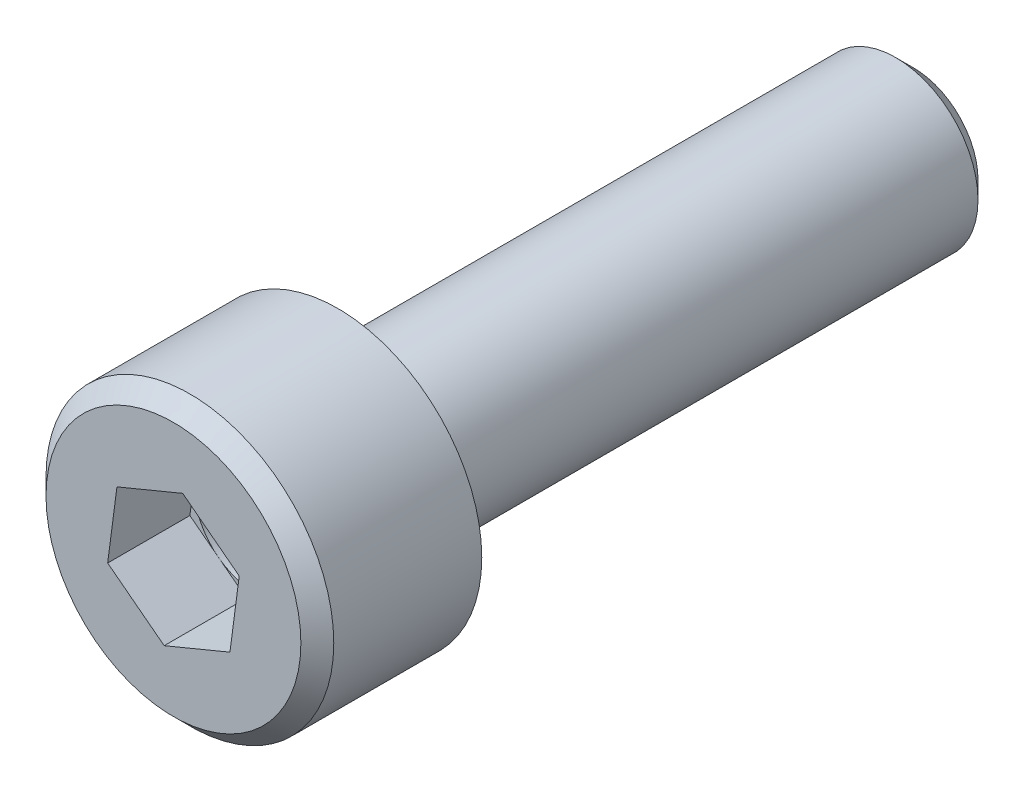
ISO-10303-21;
HEADER;
FILE_DESCRIPTION(('STEP AP214'),'2;1');
FILE_NAME('part.step','',(''),(''),'','','');
FILE_SCHEMA(('AUTOMOTIVE_DESIGN { 1 0 10303 214 1 1 1 1 }'));
ENDSEC;
DATA;
#1=APPLICATION_CONTEXT('core data for automotive mechanical design processes');
#2=APPLICATION_PROTOCOL_DEFINITION('international standard','automotive_design',2000,#1);
#3=PRODUCT_CONTEXT('',#1,'mechanical');
#4=PRODUCT('Part','Part','',(#3));
#5=PRODUCT_RELATED_PRODUCT_CATEGORY('part','',(#4));
#6=PRODUCT_DEFINITION_FORMATION('','',#4);
#7=PRODUCT_DEFINITION_CONTEXT('part definition',#1,'design');
#8=PRODUCT_DEFINITION('design','',#6,#7);
#9=PRODUCT_DEFINITION_SHAPE('','',#8);
#10=(LENGTH_UNIT() NAMED_UNIT(*) SI_UNIT(.MILLI.,.METRE.));
#11=(NAMED_UNIT(*) PLANE_ANGLE_UNIT() SI_UNIT($,.RADIAN.));
#12=(NAMED_UNIT(*) SI_UNIT($,.STERADIAN.) SOLID_ANGLE_UNIT());
#13=UNCERTAINTY_MEASURE_WITH_UNIT(LENGTH_MEASURE(1.E-05),#10,'distance_accuracy_value','');
#14=(GEOMETRIC_REPRESENTATION_CONTEXT(3) GLOBAL_UNCERTAINTY_ASSIGNED_CONTEXT((#13)) GLOBAL_UNIT_ASSIGNED_CONTEXT((#10,
#11,#12)) REPRESENTATION_CONTEXT('',''));
#15=CARTESIAN_POINT('',(0.,0.,0.));
#16=DIRECTION('',(0.,0.,1.));
#17=DIRECTION('',(1.,0.,0.));
#18=AXIS2_PLACEMENT_3D('',#15,#16,#17);
#19=CARTESIAN_POINT('',(-45.7,-8.09999999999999,7.40000000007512));
#20=DIRECTION('',(0.,0.,1.));
#21=DIRECTION('',(1.,0.,0.));
#22=AXIS2_PLACEMENT_3D('',#19,#20,#21);
#23=CONICAL_SURFACE('',#22,1.49999999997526,1.04719754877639);
#24=CARTESIAN_POINT('',(-45.6999999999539,-8.09999999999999,6.53397459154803));
#25=VERTEX_POINT('',#24);
#26=VERTEX_LOOP('',#25);
#27=FACE_BOUND('',#26,.T.);
#28=CARTESIAN_POINT('',(-45.7,-8.09999999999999,7.40000000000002));
#29=DIRECTION('',(0.,0.,-1.));
#30=DIRECTION('',(-1.,0.,0.));
#31=AXIS2_PLACEMENT_3D('',#28,#29,#30);
#32=CIRCLE('',#31,1.5);
#33=CARTESIAN_POINT('',(-47.2,-8.09999999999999,7.40000000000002));
#34=VERTEX_POINT('',#33);
#35=EDGE_CURVE('E114',#34,#34,#32,.F.);
#36=ORIENTED_EDGE('',*,*,#35,.T.);
#37=EDGE_LOOP('',(#36));
#38=FACE_BOUND('',#37,.T.);
#39=ADVANCED_FACE('F17',(#27,#38),#23,.F.);
#40=CARTESIAN_POINT('',(-45.7,-8.09999999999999,10.));
#41=DIRECTION('',(0.,0.,-1.));
#42=DIRECTION('',(-1.,0.,0.));
#43=AXIS2_PLACEMENT_3D('',#40,#41,#42);
#44=CYLINDRICAL_SURFACE('',#43,1.5);
#45=CARTESIAN_POINT('',(-45.7,-8.09999999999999,8.00000000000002));
#46=DIRECTION('',(0.,0.,-1.));
#47=DIRECTION('',(-1.,0.,0.));
#48=AXIS2_PLACEMENT_3D('',#45,#46,#47);
#49=CIRCLE('',#48,1.5);
#50=CARTESIAN_POINT('',(-44.2127553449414,-8.29520075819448,8.00000000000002));
#51=VERTEX_POINT('',#50);
#52=CARTESIAN_POINT('',(-45.1254264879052,-9.48559203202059,8.00000000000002));
#53=VERTEX_POINT('',#52);
#54=EDGE_CURVE('E100',#51,#53,#49,.T.);
#55=ORIENTED_EDGE('',*,*,#54,.F.);
#56=CARTESIAN_POINT('',(-45.7,-8.09999999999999,8.00000000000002));
#57=DIRECTION('',(0.,0.,-1.));
#58=DIRECTION('',(-1.,0.,0.));
#59=AXIS2_PLACEMENT_3D('',#56,#57,#58);
#60=CIRCLE('',#59,1.5);
#61=CARTESIAN_POINT('',(-44.7873288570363,-6.90960872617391,8.00000000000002));
#62=VERTEX_POINT('',#61);
#63=EDGE_CURVE('E107',#62,#51,#60,.T.);
#64=ORIENTED_EDGE('',*,*,#63,.F.);
#65=CARTESIAN_POINT('',(-45.7,-8.09999999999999,8.00000000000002));
#66=DIRECTION('',(0.,0.,-1.));
#67=DIRECTION('',(-1.,0.,0.));
#68=AXIS2_PLACEMENT_3D('',#65,#66,#67);
#69=CIRCLE('',#68,1.5);
#70=CARTESIAN_POINT('',(-46.2745735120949,-6.71440796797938,8.00000000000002));
#71=VERTEX_POINT('',#70);
#72=EDGE_CURVE('E115',#71,#62,#69,.T.);
#73=ORIENTED_EDGE('',*,*,#72,.F.);
#74=CARTESIAN_POINT('',(-45.7,-8.09999999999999,8.00000000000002));
#75=DIRECTION('',(0.,0.,-1.));
#76=DIRECTION('',(-1.,0.,0.));
#77=AXIS2_PLACEMENT_3D('',#74,#75,#76);
#78=CIRCLE('',#77,1.5);
#79=CARTESIAN_POINT('',(-47.1872446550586,-7.90479924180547,8.00000000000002));
#80=VERTEX_POINT('',#79);
#81=EDGE_CURVE('E211',#71,#80,#78,.F.);
#82=ORIENTED_EDGE('',*,*,#81,.T.);
#83=CARTESIAN_POINT('',(-45.7,-8.09999999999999,8.00000000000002));
#84=DIRECTION('',(0.,0.,-1.));
#85=DIRECTION('',(-1.,0.,0.));
#86=AXIS2_PLACEMENT_3D('',#83,#84,#85);
#87=CIRCLE('',#86,1.5);
#88=CARTESIAN_POINT('',(-46.6126711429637,-9.29039127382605,8.00000000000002));
#89=VERTEX_POINT('',#88);
#90=EDGE_CURVE('E215',#80,#89,#87,.F.);
#91=ORIENTED_EDGE('',*,*,#90,.T.);
#92=CARTESIAN_POINT('',(-45.7,-8.09999999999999,8.00000000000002));
#93=DIRECTION('',(0.,0.,-1.));
#94=DIRECTION('',(-1.,0.,0.));
#95=AXIS2_PLACEMENT_3D('',#92,#93,#94);
#96=CIRCLE('',#95,1.5);
#97=EDGE_CURVE('E134',#53,#89,#96,.T.);
#98=ORIENTED_EDGE('',*,*,#97,.F.);
#99=EDGE_LOOP('',(#55,#64,#73,#82,#91,#98));
#100=FACE_BOUND('',#99,.T.);
#101=ORIENTED_EDGE('',*,*,#35,.F.);
#102=EDGE_LOOP('',(#101));
#103=FACE_BOUND('',#102,.T.);
#104=ADVANCED_FACE('F131',(#100,#103),#44,.F.);
#105=CARTESIAN_POINT('',(-45.7,-8.09999999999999,8.00000000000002));
#106=DIRECTION('',(0.,0.,-1.));
#107=DIRECTION('',(-1.,0.,0.));
#108=AXIS2_PLACEMENT_3D('',#105,#106,#107);
#109=PLANE('',#108);
#110=DIRECTION('',(-0.793594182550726,0.60844742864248,0.));
#111=VECTOR('',#110,1.);
#112=CARTESIAN_POINT('',(-46.6126711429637,-9.29039127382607,8.00000000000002));
#113=LINE('',#112,#111);
#114=CARTESIAN_POINT('',(-47.2999438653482,-8.76346034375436,8.00000000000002));
#115=VERTEX_POINT('',#114);
#116=EDGE_CURVE('E216',#89,#115,#113,.T.);
#117=ORIENTED_EDGE('',*,*,#116,.F.);
#118=ORIENTED_EDGE('',*,*,#90,.F.);
#119=DIRECTION('',(0.130133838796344,0.991496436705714,0.));
#120=VECTOR('',#119,1.);
#121=CARTESIAN_POINT('',(-47.1872446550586,-7.90479924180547,8.00000000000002));
#122=LINE('',#121,#120);
#123=EDGE_CURVE('E213',#115,#80,#122,.T.);
#124=ORIENTED_EDGE('',*,*,#123,.F.);
#125=EDGE_LOOP('',(#117,#118,#124));
#126=FACE_BOUND('',#125,.T.);
#127=ADVANCED_FACE('F327',(#126),#109,.F.);
#128=CARTESIAN_POINT('',(-46.6126711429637,-9.29039127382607,9.50000000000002));
#129=DIRECTION('',(0.60844742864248,0.793594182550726,0.));
#130=DIRECTION('',(-0.793594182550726,0.60844742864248,0.));
#131=AXIS2_PLACEMENT_3D('',#128,#129,#130);
#132=PLANE('',#131);
#133=DIRECTION('',(-0.793594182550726,0.60844742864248,0.));
#134=VECTOR('',#133,1.);
#135=CARTESIAN_POINT('',(-46.6126711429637,-9.29039127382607,10.));
#136=LINE('',#135,#134);
#137=CARTESIAN_POINT('',(-47.2999438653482,-8.76346034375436,10.));
#138=VERTEX_POINT('',#137);
#139=CARTESIAN_POINT('',(-45.9253984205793,-9.81732220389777,10.));
#140=VERTEX_POINT('',#139);
#141=EDGE_CURVE('E296',#138,#140,#136,.F.);
#142=ORIENTED_EDGE('',*,*,#141,.T.);
#143=DIRECTION('',(0.,0.,1.));
#144=VECTOR('',#143,1.);
#145=CARTESIAN_POINT('',(-45.9253984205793,-9.81732220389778,10.));
#146=LINE('',#145,#144);
#147=CARTESIAN_POINT('',(-45.9253984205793,-9.81732220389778,8.00000000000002));
#148=VERTEX_POINT('',#147);
#149=EDGE_CURVE('E273',#140,#148,#146,.F.);
#150=ORIENTED_EDGE('',*,*,#149,.T.);
#151=DIRECTION('',(-0.793594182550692,0.608447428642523,0.));
#152=VECTOR('',#151,1.);
#153=CARTESIAN_POINT('',(-45.9253984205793,-9.81732220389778,8.00000000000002));
#154=LINE('',#153,#152);
#155=EDGE_CURVE('E214',#148,#89,#154,.T.);
#156=ORIENTED_EDGE('',*,*,#155,.T.);
#157=ORIENTED_EDGE('',*,*,#116,.T.);
#158=DIRECTION('',(0.,0.,1.));
#159=VECTOR('',#158,1.);
#160=CARTESIAN_POINT('',(-47.2999438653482,-8.76346034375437,9.50000000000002));
#161=LINE('',#160,#159);
#162=EDGE_CURVE('E274',#138,#115,#161,.F.);
#163=ORIENTED_EDGE('',*,*,#162,.F.);
#164=EDGE_LOOP('',(#142,#150,#156,#157,#163));
#165=FACE_BOUND('',#164,.T.);
#166=ADVANCED_FACE('F333',(#165),#132,.T.);
#167=CARTESIAN_POINT('',(-45.7,-8.09999999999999,8.00000000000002));
#168=DIRECTION('',(0.,0.,-1.));
#169=DIRECTION('',(-1.,0.,0.));
#170=AXIS2_PLACEMENT_3D('',#167,#168,#169);
#171=PLANE('',#170);
#172=DIRECTION('',(0.92372802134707,0.383049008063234,0.));
#173=VECTOR('',#172,1.);
#174=CARTESIAN_POINT('',(-45.1254264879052,-9.48559203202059,8.00000000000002));
#175=LINE('',#174,#173);
#176=EDGE_CURVE('E265',#148,#53,#175,.T.);
#177=ORIENTED_EDGE('',*,*,#176,.T.);
#178=ORIENTED_EDGE('',*,*,#97,.T.);
#179=ORIENTED_EDGE('',*,*,#155,.F.);
#180=EDGE_LOOP('',(#177,#178,#179));
#181=FACE_BOUND('',#180,.T.);
#182=ADVANCED_FACE('F469',(#181),#171,.F.);
#183=CARTESIAN_POINT('',(-45.7,-8.09999999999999,8.00000000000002));
#184=DIRECTION('',(0.,0.,-1.));
#185=DIRECTION('',(-1.,0.,0.));
#186=AXIS2_PLACEMENT_3D('',#183,#184,#185);
#187=PLANE('',#186);
#188=DIRECTION('',(0.130133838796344,0.991496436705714,0.));
#189=VECTOR('',#188,1.);
#190=CARTESIAN_POINT('',(-47.1872446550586,-7.90479924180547,8.00000000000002));
#191=LINE('',#190,#189);
#192=CARTESIAN_POINT('',(-47.074545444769,-7.04613813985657,8.00000000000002));
#193=VERTEX_POINT('',#192);
#194=EDGE_CURVE('E280',#80,#193,#191,.T.);
#195=ORIENTED_EDGE('',*,*,#194,.F.);
#196=ORIENTED_EDGE('',*,*,#81,.F.);
#197=DIRECTION('',(0.92372802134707,0.383049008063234,0.));
#198=VECTOR('',#197,1.);
#199=CARTESIAN_POINT('',(-46.2745735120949,-6.71440796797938,8.00000000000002));
#200=LINE('',#199,#198);
#201=EDGE_CURVE('E257',#193,#71,#200,.T.);
#202=ORIENTED_EDGE('',*,*,#201,.F.);
#203=EDGE_LOOP('',(#195,#196,#202));
#204=FACE_BOUND('',#203,.T.);
#205=ADVANCED_FACE('F461',(#204),#187,.F.);
#206=CARTESIAN_POINT('',(-47.1872446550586,-7.90479924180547,9.50000000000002));
#207=DIRECTION('',(0.991496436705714,-0.130133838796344,0.));
#208=DIRECTION('',(0.130133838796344,0.991496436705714,0.));
#209=AXIS2_PLACEMENT_3D('',#206,#207,#208);
#210=PLANE('',#209);
#211=DIRECTION('',(0.130133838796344,0.991496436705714,0.));
#212=VECTOR('',#211,1.);
#213=CARTESIAN_POINT('',(-47.1872446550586,-7.90479924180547,10.));
#214=LINE('',#213,#212);
#215=CARTESIAN_POINT('',(-47.074545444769,-7.04613813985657,10.));
#216=VERTEX_POINT('',#215);
#217=EDGE_CURVE('E283',#216,#138,#214,.F.);
#218=ORIENTED_EDGE('',*,*,#217,.T.);
#219=ORIENTED_EDGE('',*,*,#162,.T.);
#220=ORIENTED_EDGE('',*,*,#123,.T.);
#221=ORIENTED_EDGE('',*,*,#194,.T.);
#222=DIRECTION('',(0.,0.,1.));
#223=VECTOR('',#222,1.);
#224=CARTESIAN_POINT('',(-47.074545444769,-7.04613813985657,10.));
#225=LINE('',#224,#223);
#226=EDGE_CURVE('E246',#216,#193,#225,.F.);
#227=ORIENTED_EDGE('',*,*,#226,.F.);
#228=EDGE_LOOP('',(#218,#219,#220,#221,#227));
#229=FACE_BOUND('',#228,.T.);
#230=ADVANCED_FACE('F453',(#229),#210,.T.);
#231=CARTESIAN_POINT('',(-45.1254264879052,-9.48559203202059,10.));
#232=DIRECTION('',(0.383049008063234,-0.92372802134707,0.));
#233=DIRECTION('',(0.92372802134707,0.383049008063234,0.));
#234=AXIS2_PLACEMENT_3D('',#231,#232,#233);
#235=PLANE('',#234);
#236=ORIENTED_EDGE('',*,*,#149,.F.);
#237=DIRECTION('',(0.92372802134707,0.383049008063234,0.));
#238=VECTOR('',#237,1.);
#239=CARTESIAN_POINT('',(-45.1254264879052,-9.48559203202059,10.));
#240=LINE('',#239,#238);
#241=CARTESIAN_POINT('',(-44.325454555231,-9.1538618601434,10.));
#242=VERTEX_POINT('',#241);
#243=EDGE_CURVE('E271',#242,#140,#240,.F.);
#244=ORIENTED_EDGE('',*,*,#243,.F.);
#245=DIRECTION('',(0.,0.,1.));
#246=VECTOR('',#245,1.);
#247=CARTESIAN_POINT('',(-44.325454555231,-9.15386186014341,9.50000000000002));
#248=LINE('',#247,#246);
#249=CARTESIAN_POINT('',(-44.325454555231,-9.1538618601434,8.00000000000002));
#250=VERTEX_POINT('',#249);
#251=EDGE_CURVE('E128',#242,#250,#248,.F.);
#252=ORIENTED_EDGE('',*,*,#251,.T.);
#253=DIRECTION('',(-0.923728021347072,-0.383049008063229,0.));
#254=VECTOR('',#253,1.);
#255=CARTESIAN_POINT('',(-44.3254545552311,-9.1538618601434,8.00000000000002));
#256=LINE('',#255,#254);
#257=EDGE_CURVE('E127',#250,#53,#256,.T.);
#258=ORIENTED_EDGE('',*,*,#257,.T.);
#259=ORIENTED_EDGE('',*,*,#176,.F.);
#260=EDGE_LOOP('',(#236,#244,#252,#258,#259));
#261=FACE_BOUND('',#260,.T.);
#262=ADVANCED_FACE('F446',(#261),#235,.F.);
#263=CARTESIAN_POINT('',(-45.7,-8.09999999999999,8.00000000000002));
#264=DIRECTION('',(0.,0.,-1.));
#265=DIRECTION('',(-1.,0.,0.));
#266=AXIS2_PLACEMENT_3D('',#263,#264,#265);
#267=PLANE('',#266);
#268=DIRECTION('',(0.130133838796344,0.991496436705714,0.));
#269=VECTOR('',#268,1.);
#270=CARTESIAN_POINT('',(-44.2127553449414,-8.2952007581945,8.00000000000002));
#271=LINE('',#270,#269);
#272=EDGE_CURVE('E121',#250,#51,#271,.T.);
#273=ORIENTED_EDGE('',*,*,#272,.T.);
#274=ORIENTED_EDGE('',*,*,#54,.T.);
#275=ORIENTED_EDGE('',*,*,#257,.F.);
#276=EDGE_LOOP('',(#273,#274,#275));
#277=FACE_BOUND('',#276,.T.);
#278=ADVANCED_FACE('F126',(#277),#267,.F.);
#279=CARTESIAN_POINT('',(-45.7,-8.09999999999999,8.00000000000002));
#280=DIRECTION('',(0.,0.,-1.));
#281=DIRECTION('',(-1.,0.,0.));
#282=AXIS2_PLACEMENT_3D('',#279,#280,#281);
#283=PLANE('',#282);
#284=DIRECTION('',(0.92372802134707,0.383049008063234,0.));
#285=VECTOR('',#284,1.);
#286=CARTESIAN_POINT('',(-46.2745735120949,-6.71440796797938,8.00000000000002));
#287=LINE('',#286,#285);
#288=CARTESIAN_POINT('',(-45.4746015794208,-6.38267779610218,8.00000000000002));
#289=VERTEX_POINT('',#288);
#290=EDGE_CURVE('E222',#71,#289,#287,.T.);
#291=ORIENTED_EDGE('',*,*,#290,.F.);
#292=ORIENTED_EDGE('',*,*,#72,.T.);
#293=DIRECTION('',(-0.793594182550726,0.60844742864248,0.));
#294=VECTOR('',#293,1.);
#295=CARTESIAN_POINT('',(-44.7873288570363,-6.9096087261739,8.00000000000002));
#296=LINE('',#295,#294);
#297=EDGE_CURVE('E124',#62,#289,#296,.T.);
#298=ORIENTED_EDGE('',*,*,#297,.T.);
#299=EDGE_LOOP('',(#291,#292,#298));
#300=FACE_BOUND('',#299,.T.);
#301=ADVANCED_FACE('F220',(#300),#283,.F.);
#302=CARTESIAN_POINT('',(-46.2745735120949,-6.71440796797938,10.));
#303=DIRECTION('',(0.383049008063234,-0.92372802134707,0.));
#304=DIRECTION('',(0.92372802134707,0.383049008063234,0.));
#305=AXIS2_PLACEMENT_3D('',#302,#303,#304);
#306=PLANE('',#305);
#307=DIRECTION('',(0.92372802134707,0.383049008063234,0.));
#308=VECTOR('',#307,1.);
#309=CARTESIAN_POINT('',(-46.2745735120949,-6.71440796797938,10.));
#310=LINE('',#309,#308);
#311=CARTESIAN_POINT('',(-45.4746015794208,-6.38267779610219,10.));
#312=VERTEX_POINT('',#311);
#313=EDGE_CURVE('E253',#312,#216,#310,.F.);
#314=ORIENTED_EDGE('',*,*,#313,.T.);
#315=ORIENTED_EDGE('',*,*,#226,.T.);
#316=ORIENTED_EDGE('',*,*,#201,.T.);
#317=ORIENTED_EDGE('',*,*,#290,.T.);
#318=DIRECTION('',(0.,0.,1.));
#319=VECTOR('',#318,1.);
#320=CARTESIAN_POINT('',(-45.4746015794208,-6.38267779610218,9.50000000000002));
#321=LINE('',#320,#319);
#322=EDGE_CURVE('E230',#289,#312,#321,.T.);
#323=ORIENTED_EDGE('',*,*,#322,.T.);
#324=EDGE_LOOP('',(#314,#315,#316,#317,#323));
#325=FACE_BOUND('',#324,.T.);
#326=ADVANCED_FACE('F426',(#325),#306,.T.);
#327=CARTESIAN_POINT('',(-44.2127553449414,-8.2952007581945,9.50000000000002));
#328=DIRECTION('',(0.991496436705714,-0.130133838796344,0.));
#329=DIRECTION('',(0.130133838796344,0.991496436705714,0.));
#330=AXIS2_PLACEMENT_3D('',#327,#328,#329);
#331=PLANE('',#330);
#332=ORIENTED_EDGE('',*,*,#251,.F.);
#333=DIRECTION('',(0.130133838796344,0.991496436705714,0.));
#334=VECTOR('',#333,1.);
#335=CARTESIAN_POINT('',(-44.2127553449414,-8.2952007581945,10.));
#336=LINE('',#335,#334);
#337=CARTESIAN_POINT('',(-44.1000561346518,-7.43653965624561,10.));
#338=VERTEX_POINT('',#337);
#339=EDGE_CURVE('E244',#338,#242,#336,.F.);
#340=ORIENTED_EDGE('',*,*,#339,.F.);
#341=DIRECTION('',(0.,0.,1.));
#342=VECTOR('',#341,1.);
#343=CARTESIAN_POINT('',(-44.1000561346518,-7.43653965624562,9.50000000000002));
#344=LINE('',#343,#342);
#345=CARTESIAN_POINT('',(-44.1000561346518,-7.43653965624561,8.00000000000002));
#346=VERTEX_POINT('',#345);
#347=EDGE_CURVE('E123',#338,#346,#344,.F.);
#348=ORIENTED_EDGE('',*,*,#347,.T.);
#349=DIRECTION('',(-0.130133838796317,-0.991496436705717,0.));
#350=VECTOR('',#349,1.);
#351=CARTESIAN_POINT('',(-44.1000561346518,-7.4365396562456,8.00000000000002));
#352=LINE('',#351,#350);
#353=EDGE_CURVE('E110',#346,#51,#352,.T.);
#354=ORIENTED_EDGE('',*,*,#353,.T.);
#355=ORIENTED_EDGE('',*,*,#272,.F.);
#356=EDGE_LOOP('',(#332,#340,#348,#354,#355));
#357=FACE_BOUND('',#356,.T.);
#358=ADVANCED_FACE('F120',(#357),#331,.F.);
#359=CARTESIAN_POINT('',(-45.7,-8.09999999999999,8.00000000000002));
#360=DIRECTION('',(0.,0.,-1.));
#361=DIRECTION('',(-1.,0.,0.));
#362=AXIS2_PLACEMENT_3D('',#359,#360,#361);
#363=PLANE('',#362);
#364=DIRECTION('',(-0.793594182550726,0.60844742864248,0.));
#365=VECTOR('',#364,1.);
#366=CARTESIAN_POINT('',(-44.7873288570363,-6.9096087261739,8.00000000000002));
#367=LINE('',#366,#365);
#368=EDGE_CURVE('E112',#346,#62,#367,.T.);
#369=ORIENTED_EDGE('',*,*,#368,.T.);
#370=ORIENTED_EDGE('',*,*,#63,.T.);
#371=ORIENTED_EDGE('',*,*,#353,.F.);
#372=EDGE_LOOP('',(#369,#370,#371));
#373=FACE_BOUND('',#372,.T.);
#374=ADVANCED_FACE('F109',(#373),#363,.F.);
#375=CARTESIAN_POINT('',(-44.7873288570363,-6.9096087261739,9.50000000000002));
#376=DIRECTION('',(0.60844742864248,0.793594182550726,0.));
#377=DIRECTION('',(-0.793594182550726,0.60844742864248,0.));
#378=AXIS2_PLACEMENT_3D('',#375,#376,#377);
#379=PLANE('',#378);
#380=ORIENTED_EDGE('',*,*,#347,.F.);
#381=DIRECTION('',(0.793594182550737,-0.608447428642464,0.));
#382=VECTOR('',#381,1.);
#383=CARTESIAN_POINT('',(-45.4746015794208,-6.38267779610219,10.));
#384=LINE('',#383,#382);
#385=EDGE_CURVE('E210',#312,#338,#384,.T.);
#386=ORIENTED_EDGE('',*,*,#385,.F.);
#387=ORIENTED_EDGE('',*,*,#322,.F.);
#388=ORIENTED_EDGE('',*,*,#297,.F.);
#389=ORIENTED_EDGE('',*,*,#368,.F.);
#390=EDGE_LOOP('',(#380,#386,#387,#388,#389));
#391=FACE_BOUND('',#390,.T.);
#392=ADVANCED_FACE('F227',(#391),#379,.F.);
#393=CARTESIAN_POINT('',(-45.7,-8.09999999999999,10.));
#394=DIRECTION('',(0.,0.,1.));
#395=DIRECTION('',(1.,0.,0.));
#396=AXIS2_PLACEMENT_3D('',#393,#394,#395);
#397=PLANE('',#396);
#398=ORIENTED_EDGE('',*,*,#313,.F.);
#399=ORIENTED_EDGE('',*,*,#385,.T.);
#400=ORIENTED_EDGE('',*,*,#339,.T.);
#401=ORIENTED_EDGE('',*,*,#243,.T.);
#402=ORIENTED_EDGE('',*,*,#141,.F.);
#403=ORIENTED_EDGE('',*,*,#217,.F.);
#404=EDGE_LOOP('',(#398,#399,#400,#401,#402,#403));
#405=FACE_BOUND('',#404,.T.);
#406=CARTESIAN_POINT('',(-45.7,-8.09999999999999,10.000000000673));
#407=DIRECTION('',(0.,0.,-1.));
#408=DIRECTION('',(-1.,0.,0.));
#409=AXIS2_PLACEMENT_3D('',#406,#407,#408);
#410=CIRCLE('',#409,3.10000000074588);
#411=CARTESIAN_POINT('',(-48.8000000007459,-8.09999999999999,10.000000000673));
#412=VERTEX_POINT('',#411);
#413=EDGE_CURVE('E202',#412,#412,#410,.T.);
#414=ORIENTED_EDGE('',*,*,#413,.F.);
#415=EDGE_LOOP('',(#414));
#416=FACE_BOUND('',#415,.T.);
#417=ADVANCED_FACE('F400',(#405,#416),#397,.T.);
#418=CARTESIAN_POINT('',(-45.7,-8.09999999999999,9.59999999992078));
#419=DIRECTION('',(0.,0.,-1.));
#420=DIRECTION('',(-1.,0.,0.));
#421=AXIS2_PLACEMENT_3D('',#418,#419,#420);
#422=CONICAL_SURFACE('',#421,3.50000000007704,0.785398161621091);
#423=CARTESIAN_POINT('',(-45.7,-8.09999999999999,9.60000000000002));
#424=DIRECTION('',(0.,0.,1.));
#425=DIRECTION('',(1.,0.,0.));
#426=AXIS2_PLACEMENT_3D('',#423,#424,#425);
#427=CIRCLE('',#426,3.5);
#428=CARTESIAN_POINT('',(-42.2,-8.09999999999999,9.60000000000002));
#429=VERTEX_POINT('',#428);
#430=EDGE_CURVE('E198',#429,#429,#427,.F.);
#431=ORIENTED_EDGE('',*,*,#430,.F.);
#432=EDGE_LOOP('',(#431));
#433=FACE_BOUND('',#432,.T.);
#434=ORIENTED_EDGE('',*,*,#413,.T.);
#435=EDGE_LOOP('',(#434));
#436=FACE_BOUND('',#435,.T.);
#437=ADVANCED_FACE('F393',(#433,#436),#422,.T.);
#438=CARTESIAN_POINT('',(-45.7,-8.09999999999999,6.00000000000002));
#439=DIRECTION('',(0.,0.,1.));
#440=DIRECTION('',(1.,0.,0.));
#441=AXIS2_PLACEMENT_3D('',#438,#439,#440);
#442=CYLINDRICAL_SURFACE('',#441,3.5);
#443=ORIENTED_EDGE('',*,*,#430,.T.);
#444=EDGE_LOOP('',(#443));
#445=FACE_BOUND('',#444,.T.);
#446=CARTESIAN_POINT('',(-45.7,-8.09999999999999,6.00000000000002));
#447=DIRECTION('',(0.,0.,1.));
#448=DIRECTION('',(1.,0.,0.));
#449=AXIS2_PLACEMENT_3D('',#446,#447,#448);
#450=CIRCLE('',#449,3.5);
#451=CARTESIAN_POINT('',(-42.2,-8.09999999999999,6.00000000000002));
#452=VERTEX_POINT('',#451);
#453=EDGE_CURVE('E196',#452,#452,#450,.F.);
#454=ORIENTED_EDGE('',*,*,#453,.F.);
#455=EDGE_LOOP('',(#454));
#456=FACE_BOUND('',#455,.T.);
#457=ADVANCED_FACE('F178',(#445,#456),#442,.T.);
#458=CARTESIAN_POINT('',(-45.7,-8.09999999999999,6.00000000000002));
#459=DIRECTION('',(0.,0.,-1.));
#460=DIRECTION('',(-1.,0.,0.));
#461=AXIS2_PLACEMENT_3D('',#458,#459,#460);
#462=PLANE('',#461);
#463=CARTESIAN_POINT('',(-45.7,-8.09999999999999,6.00000000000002));
#464=DIRECTION('',(0.,0.,-1.));
#465=DIRECTION('',(-1.,0.,0.));
#466=AXIS2_PLACEMENT_3D('',#463,#464,#465);
#467=CIRCLE('',#466,2.2);
#468=CARTESIAN_POINT('',(-43.5,-8.09999999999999,6.00000000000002));
#469=VERTEX_POINT('',#468);
#470=CARTESIAN_POINT('',(-47.9,-8.09999999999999,6.00000000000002));
#471=VERTEX_POINT('',#470);
#472=EDGE_CURVE('E37',#469,#471,#467,.F.);
#473=ORIENTED_EDGE('',*,*,#472,.T.);
#474=CARTESIAN_POINT('',(-45.7,-8.09999999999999,6.00000000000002));
#475=DIRECTION('',(0.,0.,-1.));
#476=DIRECTION('',(0.383049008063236,-0.923728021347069,0.));
#477=AXIS2_PLACEMENT_3D('',#474,#475,#476);
#478=CIRCLE('',#477,2.19999999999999);
#479=CARTESIAN_POINT('',(-44.8572921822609,-10.1322016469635,6.00000000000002));
#480=VERTEX_POINT('',#479);
#481=EDGE_CURVE('E194',#471,#480,#478,.F.);
#482=ORIENTED_EDGE('',*,*,#481,.T.);
#483=CARTESIAN_POINT('',(-45.7,-8.09999999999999,6.00000000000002));
#484=DIRECTION('',(0.,0.,-1.));
#485=DIRECTION('',(1.,0.,0.));
#486=AXIS2_PLACEMENT_3D('',#483,#484,#485);
#487=CIRCLE('',#486,2.19999999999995);
#488=EDGE_CURVE('E142',#480,#469,#487,.F.);
#489=ORIENTED_EDGE('',*,*,#488,.T.);
#490=EDGE_LOOP('',(#473,#482,#489));
#491=FACE_BOUND('',#490,.T.);
#492=ORIENTED_EDGE('',*,*,#453,.T.);
#493=EDGE_LOOP('',(#492));
#494=FACE_BOUND('',#493,.T.);
#495=ADVANCED_FACE('F169',(#491,#494),#462,.T.);
#496=CARTESIAN_POINT('',(-45.7,-8.09999999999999,-7.99999999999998));
#497=DIRECTION('',(0.,0.,-1.));
#498=DIRECTION('',(-1.,0.,0.));
#499=AXIS2_PLACEMENT_3D('',#496,#497,#498);
#500=PLANE('',#499);
#501=CARTESIAN_POINT('',(-45.7,-8.09999999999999,-7.99999999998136));
#502=DIRECTION('',(0.,0.,1.));
#503=DIRECTION('',(1.,0.,0.));
#504=AXIS2_PLACEMENT_3D('',#501,#502,#503);
#505=CIRCLE('',#504,1.57058499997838);
#506=CARTESIAN_POINT('',(-44.1294150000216,-8.09999999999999,-7.99999999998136));
#507=VERTEX_POINT('',#506);
#508=EDGE_CURVE('E206',#507,#507,#505,.T.);
#509=ORIENTED_EDGE('',*,*,#508,.F.);
#510=EDGE_LOOP('',(#509));
#511=FACE_BOUND('',#510,.T.);
#512=ADVANCED_FACE('F157',(#511),#500,.T.);
#513=CARTESIAN_POINT('',(-45.7,-8.09999999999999,5.80000000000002));
#514=DIRECTION('',(0.,0.,-1.));
#515=DIRECTION('',(1.,0.,0.));
#516=AXIS2_PLACEMENT_3D('',#513,#514,#515);
#517=TOROIDAL_SURFACE('',#516,2.2,0.2);
#518=ORIENTED_EDGE('',*,*,#472,.F.);
#519=ORIENTED_EDGE('',*,*,#488,.F.);
#520=ORIENTED_EDGE('',*,*,#481,.F.);
#521=EDGE_LOOP('',(#518,#519,#520));
#522=FACE_BOUND('',#521,.T.);
#523=CARTESIAN_POINT('',(-45.7,-8.09999999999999,5.80000000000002));
#524=DIRECTION('',(0.,0.,-1.));
#525=DIRECTION('',(-1.,0.,0.));
#526=AXIS2_PLACEMENT_3D('',#523,#524,#525);
#527=CIRCLE('',#526,2.);
#528=CARTESIAN_POINT('',(-47.7,-8.09999999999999,5.80000000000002));
#529=VERTEX_POINT('',#528);
#530=EDGE_CURVE('E28',#529,#529,#527,.T.);
#531=ORIENTED_EDGE('',*,*,#530,.F.);
#532=EDGE_LOOP('',(#531));
#533=FACE_BOUND('',#532,.T.);
#534=ADVANCED_FACE('F145',(#522,#533),#517,.F.);
#535=CARTESIAN_POINT('',(-45.7,-8.09999999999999,-7.57058499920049));
#536=DIRECTION('',(0.,0.,1.));
#537=DIRECTION('',(1.,0.,0.));
#538=AXIS2_PLACEMENT_3D('',#535,#536,#537);
#539=CONICAL_SURFACE('',#538,1.99999999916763,0.78539816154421);
#540=CARTESIAN_POINT('',(-45.7,-8.09999999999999,-7.57058499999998));
#541=DIRECTION('',(0.,0.,-1.));
#542=DIRECTION('',(-1.,0.,0.));
#543=AXIS2_PLACEMENT_3D('',#540,#541,#542);
#544=CIRCLE('',#543,2.);
#545=CARTESIAN_POINT('',(-47.7,-8.09999999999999,-7.57058499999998));
#546=VERTEX_POINT('',#545);
#547=EDGE_CURVE('E11',#546,#546,#544,.F.);
#548=ORIENTED_EDGE('',*,*,#547,.F.);
#549=EDGE_LOOP('',(#548));
#550=FACE_BOUND('',#549,.T.);
#551=ORIENTED_EDGE('',*,*,#508,.T.);
#552=EDGE_LOOP('',(#551));
#553=FACE_BOUND('',#552,.T.);
#554=ADVANCED_FACE('F156',(#550,#553),#539,.T.);
#555=CARTESIAN_POINT('',(-45.7,-8.09999999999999,6.00000000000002));
#556=DIRECTION('',(0.,0.,-1.));
#557=DIRECTION('',(-1.,0.,0.));
#558=AXIS2_PLACEMENT_3D('',#555,#556,#557);
#559=CYLINDRICAL_SURFACE('',#558,2.);
#560=ORIENTED_EDGE('',*,*,#530,.T.);
#561=EDGE_LOOP('',(#560));
#562=FACE_BOUND('',#561,.T.);
#563=ORIENTED_EDGE('',*,*,#547,.T.);
#564=EDGE_LOOP('',(#563));
#565=FACE_BOUND('',#564,.T.);
#566=ADVANCED_FACE('F337',(#562,#565),#559,.T.);
#567=CLOSED_SHELL('',(#39,#104,#127,#166,#182,#205,#230,#262,#278,#301,#326,#358,#374,#392,#417,
#437,#457,#495,#512,#534,#554,#566));
#568=MANIFOLD_SOLID_BREP('B1',#567);
#569=ADVANCED_BREP_SHAPE_REPRESENTATION('',(#18,#568),#14);
#570=SHAPE_DEFINITION_REPRESENTATION(#9,#569);
ENDSEC;
END-ISO-10303-21;
